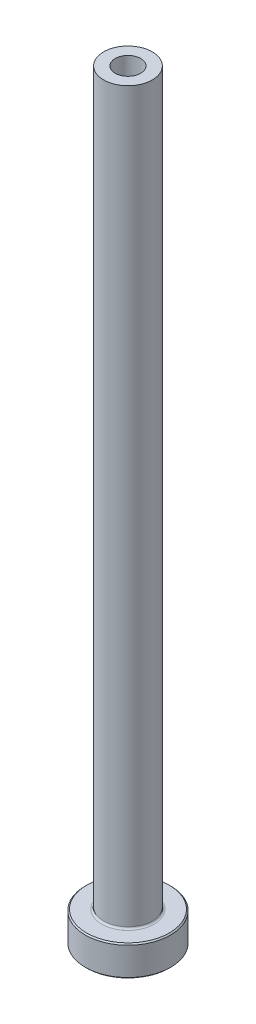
ISO-10303-21;
HEADER;
FILE_DESCRIPTION(('STEP AP214'),'2;1');
FILE_NAME('part.step','',(''),(''),'','','');
FILE_SCHEMA(('AUTOMOTIVE_DESIGN { 1 0 10303 214 1 1 1 1 }'));
ENDSEC;
DATA;
#1=APPLICATION_CONTEXT('core data for automotive mechanical design processes');
#2=APPLICATION_PROTOCOL_DEFINITION('international standard','automotive_design',2000,#1);
#3=PRODUCT_CONTEXT('',#1,'mechanical');
#4=PRODUCT('Part','Part','',(#3));
#5=PRODUCT_RELATED_PRODUCT_CATEGORY('part','',(#4));
#6=PRODUCT_DEFINITION_FORMATION('','',#4);
#7=PRODUCT_DEFINITION_CONTEXT('part definition',#1,'design');
#8=PRODUCT_DEFINITION('design','',#6,#7);
#9=PRODUCT_DEFINITION_SHAPE('','',#8);
#10=(LENGTH_UNIT() NAMED_UNIT(*) SI_UNIT(.MILLI.,.METRE.));
#11=(NAMED_UNIT(*) PLANE_ANGLE_UNIT() SI_UNIT($,.RADIAN.));
#12=(NAMED_UNIT(*) SI_UNIT($,.STERADIAN.) SOLID_ANGLE_UNIT());
#13=UNCERTAINTY_MEASURE_WITH_UNIT(LENGTH_MEASURE(1.E-05),#10,'distance_accuracy_value','');
#14=(GEOMETRIC_REPRESENTATION_CONTEXT(3) GLOBAL_UNCERTAINTY_ASSIGNED_CONTEXT((#13)) GLOBAL_UNIT_ASSIGNED_CONTEXT((#10,
#11,#12)) REPRESENTATION_CONTEXT('',''));
#15=CARTESIAN_POINT('',(0.,0.,0.));
#16=DIRECTION('',(0.,0.,1.));
#17=DIRECTION('',(1.,0.,0.));
#18=AXIS2_PLACEMENT_3D('',#15,#16,#17);
#19=CARTESIAN_POINT('',(0.,92.1876809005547,0.));
#20=DIRECTION('',(0.,1.,0.));
#21=DIRECTION('',(0.,0.,1.));
#22=AXIS2_PLACEMENT_3D('',#19,#20,#21);
#23=CYLINDRICAL_SURFACE('',#22,2.1);
#24=CARTESIAN_POINT('',(0.,125.,0.));
#25=DIRECTION('',(0.,1.,0.));
#26=DIRECTION('',(0.,0.,1.));
#27=AXIS2_PLACEMENT_3D('',#24,#25,#26);
#28=CIRCLE('',#27,2.1);
#29=CARTESIAN_POINT('',(0.,125.,2.1));
#30=VERTEX_POINT('',#29);
#31=EDGE_CURVE('E62',#30,#30,#28,.T.);
#32=ORIENTED_EDGE('',*,*,#31,.T.);
#33=EDGE_LOOP('',(#32));
#34=FACE_BOUND('',#33,.T.);
#35=CARTESIAN_POINT('',(0.,80.,0.));
#36=DIRECTION('',(0.,1.,0.));
#37=DIRECTION('',(0.,0.,1.));
#38=AXIS2_PLACEMENT_3D('',#35,#36,#37);
#39=CIRCLE('',#38,2.1);
#40=CARTESIAN_POINT('',(0.,80.,2.1));
#41=VERTEX_POINT('',#40);
#42=EDGE_CURVE('E71',#41,#41,#39,.T.);
#43=ORIENTED_EDGE('',*,*,#42,.F.);
#44=EDGE_LOOP('',(#43));
#45=FACE_BOUND('',#44,.T.);
#46=ADVANCED_FACE('F30',(#34,#45),#23,.F.);
#47=CARTESIAN_POINT('',(-2.1,125.,0.));
#48=DIRECTION('',(0.,1.,0.));
#49=DIRECTION('',(0.,0.,1.));
#50=AXIS2_PLACEMENT_3D('',#47,#48,#49);
#51=PLANE('',#50);
#52=CARTESIAN_POINT('',(0.,125.,0.));
#53=DIRECTION('',(0.,1.,0.));
#54=DIRECTION('',(0.,0.,1.));
#55=AXIS2_PLACEMENT_3D('',#52,#53,#54);
#56=CIRCLE('',#55,4.);
#57=CARTESIAN_POINT('',(0.,125.,4.));
#58=VERTEX_POINT('',#57);
#59=EDGE_CURVE('E65',#58,#58,#56,.T.);
#60=ORIENTED_EDGE('',*,*,#59,.T.);
#61=EDGE_LOOP('',(#60));
#62=FACE_BOUND('',#61,.T.);
#63=ORIENTED_EDGE('',*,*,#31,.F.);
#64=EDGE_LOOP('',(#63));
#65=FACE_BOUND('',#64,.T.);
#66=ADVANCED_FACE('F79',(#62,#65),#51,.T.);
#67=CARTESIAN_POINT('',(0.,92.1876809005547,0.));
#68=DIRECTION('',(0.,1.,0.));
#69=DIRECTION('',(0.,0.,1.));
#70=AXIS2_PLACEMENT_3D('',#67,#68,#69);
#71=CYLINDRICAL_SURFACE('',#70,4.);
#72=CARTESIAN_POINT('',(0.,5.3,0.));
#73=DIRECTION('',(0.,1.,0.));
#74=DIRECTION('',(0.,0.,1.));
#75=AXIS2_PLACEMENT_3D('',#72,#73,#74);
#76=CIRCLE('',#75,4.);
#77=CARTESIAN_POINT('',(0.,5.3,4.));
#78=VERTEX_POINT('',#77);
#79=EDGE_CURVE('E59',#78,#78,#76,.T.);
#80=ORIENTED_EDGE('',*,*,#79,.T.);
#81=EDGE_LOOP('',(#80));
#82=FACE_BOUND('',#81,.T.);
#83=ORIENTED_EDGE('',*,*,#59,.F.);
#84=EDGE_LOOP('',(#83));
#85=FACE_BOUND('',#84,.T.);
#86=ADVANCED_FACE('F85',(#82,#85),#71,.T.);
#87=CARTESIAN_POINT('',(-3.99999999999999,5.,0.));
#88=DIRECTION('',(0.,1.,0.));
#89=DIRECTION('',(0.,0.,1.));
#90=AXIS2_PLACEMENT_3D('',#87,#88,#89);
#91=PLANE('',#90);
#92=CARTESIAN_POINT('',(0.,5.,0.));
#93=DIRECTION('',(0.,1.,0.));
#94=DIRECTION('',(0.,0.,1.));
#95=AXIS2_PLACEMENT_3D('',#92,#93,#94);
#96=CIRCLE('',#95,6.79999999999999);
#97=CARTESIAN_POINT('',(0.,5.,6.79999999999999));
#98=VERTEX_POINT('',#97);
#99=EDGE_CURVE('E53',#98,#98,#96,.T.);
#100=ORIENTED_EDGE('',*,*,#99,.T.);
#101=EDGE_LOOP('',(#100));
#102=FACE_BOUND('',#101,.T.);
#103=CARTESIAN_POINT('',(0.,5.,0.));
#104=DIRECTION('',(0.,1.,0.));
#105=DIRECTION('',(0.,0.,1.));
#106=AXIS2_PLACEMENT_3D('',#103,#104,#105);
#107=CIRCLE('',#106,4.3);
#108=CARTESIAN_POINT('',(0.,5.,4.3));
#109=VERTEX_POINT('',#108);
#110=EDGE_CURVE('E56',#109,#109,#107,.F.);
#111=ORIENTED_EDGE('',*,*,#110,.T.);
#112=EDGE_LOOP('',(#111));
#113=FACE_BOUND('',#112,.T.);
#114=ADVANCED_FACE('F111',(#102,#113),#91,.T.);
#115=CARTESIAN_POINT('',(0.,92.1876809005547,0.));
#116=DIRECTION('',(0.,1.,0.));
#117=DIRECTION('',(0.,0.,1.));
#118=AXIS2_PLACEMENT_3D('',#115,#116,#117);
#119=CYLINDRICAL_SURFACE('',#118,6.99999999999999);
#120=CARTESIAN_POINT('',(0.,4.8,0.));
#121=DIRECTION('',(0.,1.,0.));
#122=DIRECTION('',(0.,0.,1.));
#123=AXIS2_PLACEMENT_3D('',#120,#121,#122);
#124=CIRCLE('',#123,6.99999999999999);
#125=CARTESIAN_POINT('',(0.,4.8,6.99999999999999));
#126=VERTEX_POINT('',#125);
#127=EDGE_CURVE('E45',#126,#126,#124,.F.);
#128=ORIENTED_EDGE('',*,*,#127,.T.);
#129=EDGE_LOOP('',(#128));
#130=FACE_BOUND('',#129,.T.);
#131=CARTESIAN_POINT('',(0.,0.200000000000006,0.));
#132=DIRECTION('',(0.,-1.,0.));
#133=DIRECTION('',(0.,0.,-1.));
#134=AXIS2_PLACEMENT_3D('',#131,#132,#133);
#135=CIRCLE('',#134,6.99999999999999);
#136=CARTESIAN_POINT('',(0.,0.200000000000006,-6.99999999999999));
#137=VERTEX_POINT('',#136);
#138=EDGE_CURVE('E50',#137,#137,#135,.F.);
#139=ORIENTED_EDGE('',*,*,#138,.T.);
#140=EDGE_LOOP('',(#139));
#141=FACE_BOUND('',#140,.T.);
#142=ADVANCED_FACE('F108',(#130,#141),#119,.T.);
#143=CARTESIAN_POINT('',(-6.99999999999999,0.,0.));
#144=DIRECTION('',(0.,-1.,0.));
#145=DIRECTION('',(0.,0.,-1.));
#146=AXIS2_PLACEMENT_3D('',#143,#144,#145);
#147=PLANE('',#146);
#148=CARTESIAN_POINT('',(0.,0.,0.));
#149=DIRECTION('',(0.,-1.,0.));
#150=DIRECTION('',(0.,0.,-1.));
#151=AXIS2_PLACEMENT_3D('',#148,#149,#150);
#152=CIRCLE('',#151,2.84999999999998);
#153=CARTESIAN_POINT('',(0.,0.,-2.84999999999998));
#154=VERTEX_POINT('',#153);
#155=EDGE_CURVE('E37',#154,#154,#152,.F.);
#156=ORIENTED_EDGE('',*,*,#155,.T.);
#157=EDGE_LOOP('',(#156));
#158=FACE_BOUND('',#157,.T.);
#159=CARTESIAN_POINT('',(0.,0.,0.));
#160=DIRECTION('',(0.,-1.,0.));
#161=DIRECTION('',(0.,0.,-1.));
#162=AXIS2_PLACEMENT_3D('',#159,#160,#161);
#163=CIRCLE('',#162,6.8);
#164=CARTESIAN_POINT('',(0.,0.,-6.8));
#165=VERTEX_POINT('',#164);
#166=EDGE_CURVE('E41',#165,#165,#163,.T.);
#167=ORIENTED_EDGE('',*,*,#166,.T.);
#168=EDGE_LOOP('',(#167));
#169=FACE_BOUND('',#168,.T.);
#170=ADVANCED_FACE('F110',(#158,#169),#147,.T.);
#171=CARTESIAN_POINT('',(0.,92.1876809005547,0.));
#172=DIRECTION('',(0.,1.,0.));
#173=DIRECTION('',(0.,0.,1.));
#174=AXIS2_PLACEMENT_3D('',#171,#172,#173);
#175=CYLINDRICAL_SURFACE('',#174,2.34999999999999);
#176=CARTESIAN_POINT('',(0.,0.5,0.));
#177=DIRECTION('',(0.,-1.,0.));
#178=DIRECTION('',(0.,0.,-1.));
#179=AXIS2_PLACEMENT_3D('',#176,#177,#178);
#180=CIRCLE('',#179,2.34999999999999);
#181=CARTESIAN_POINT('',(0.,0.5,-2.34999999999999));
#182=VERTEX_POINT('',#181);
#183=EDGE_CURVE('E10',#182,#182,#180,.T.);
#184=ORIENTED_EDGE('',*,*,#183,.T.);
#185=EDGE_LOOP('',(#184));
#186=FACE_BOUND('',#185,.T.);
#187=CARTESIAN_POINT('',(0.,68.,0.));
#188=DIRECTION('',(0.,1.,0.));
#189=DIRECTION('',(0.,0.,1.));
#190=AXIS2_PLACEMENT_3D('',#187,#188,#189);
#191=CIRCLE('',#190,2.35);
#192=CARTESIAN_POINT('',(0.,68.,2.35));
#193=VERTEX_POINT('',#192);
#194=EDGE_CURVE('E68',#193,#193,#191,.T.);
#195=ORIENTED_EDGE('',*,*,#194,.T.);
#196=EDGE_LOOP('',(#195));
#197=FACE_BOUND('',#196,.T.);
#198=ADVANCED_FACE('F118',(#186,#197),#175,.F.);
#199=CARTESIAN_POINT('',(0.,68.,0.));
#200=DIRECTION('',(0.,-1.,0.));
#201=DIRECTION('',(0.,0.,-1.));
#202=AXIS2_PLACEMENT_3D('',#199,#200,#201);
#203=CONICAL_SURFACE('',#202,2.35,0.0208303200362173);
#204=ORIENTED_EDGE('',*,*,#42,.T.);
#205=EDGE_LOOP('',(#204));
#206=FACE_BOUND('',#205,.T.);
#207=ORIENTED_EDGE('',*,*,#194,.F.);
#208=EDGE_LOOP('',(#207));
#209=FACE_BOUND('',#208,.T.);
#210=ADVANCED_FACE('F75',(#206,#209),#203,.F.);
#211=CARTESIAN_POINT('',(0.,5.3,0.));
#212=DIRECTION('',(0.,1.,0.));
#213=DIRECTION('',(0.,0.,1.));
#214=AXIS2_PLACEMENT_3D('',#211,#212,#213);
#215=TOROIDAL_SURFACE('',#214,4.3,0.3);
#216=ORIENTED_EDGE('',*,*,#110,.F.);
#217=EDGE_LOOP('',(#216));
#218=FACE_BOUND('',#217,.T.);
#219=ORIENTED_EDGE('',*,*,#79,.F.);
#220=EDGE_LOOP('',(#219));
#221=FACE_BOUND('',#220,.T.);
#222=ADVANCED_FACE('F90',(#218,#221),#215,.F.);
#223=CARTESIAN_POINT('',(0.,5.,0.));
#224=DIRECTION('',(0.,-1.,0.));
#225=DIRECTION('',(0.,0.,-1.));
#226=AXIS2_PLACEMENT_3D('',#223,#224,#225);
#227=CONICAL_SURFACE('',#226,6.79999999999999,0.78539816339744);
#228=ORIENTED_EDGE('',*,*,#127,.F.);
#229=EDGE_LOOP('',(#228));
#230=FACE_BOUND('',#229,.T.);
#231=ORIENTED_EDGE('',*,*,#99,.F.);
#232=EDGE_LOOP('',(#231));
#233=FACE_BOUND('',#232,.T.);
#234=ADVANCED_FACE('F93',(#230,#233),#227,.T.);
#235=CARTESIAN_POINT('',(0.,0.200000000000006,0.));
#236=DIRECTION('',(0.,1.,0.));
#237=DIRECTION('',(0.,0.,1.));
#238=AXIS2_PLACEMENT_3D('',#235,#236,#237);
#239=CONICAL_SURFACE('',#238,6.99999999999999,0.785398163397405);
#240=ORIENTED_EDGE('',*,*,#166,.F.);
#241=EDGE_LOOP('',(#240));
#242=FACE_BOUND('',#241,.T.);
#243=ORIENTED_EDGE('',*,*,#138,.F.);
#244=EDGE_LOOP('',(#243));
#245=FACE_BOUND('',#244,.T.);
#246=ADVANCED_FACE('F96',(#242,#245),#239,.T.);
#247=CARTESIAN_POINT('',(0.,0.,0.));
#248=DIRECTION('',(0.,-1.,0.));
#249=DIRECTION('',(0.,0.,-1.));
#250=AXIS2_PLACEMENT_3D('',#247,#248,#249);
#251=CONICAL_SURFACE('',#250,2.84999999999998,0.785398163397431);
#252=ORIENTED_EDGE('',*,*,#183,.F.);
#253=EDGE_LOOP('',(#252));
#254=FACE_BOUND('',#253,.T.);
#255=ORIENTED_EDGE('',*,*,#155,.F.);
#256=EDGE_LOOP('',(#255));
#257=FACE_BOUND('',#256,.T.);
#258=ADVANCED_FACE('F32',(#254,#257),#251,.F.);
#259=CLOSED_SHELL('',(#46,#66,#86,#114,#142,#170,#198,#210,#222,#234,#246,#258));
#260=MANIFOLD_SOLID_BREP('B2',#259);
#261=ADVANCED_BREP_SHAPE_REPRESENTATION('',(#18,#260),#14);
#262=SHAPE_DEFINITION_REPRESENTATION(#9,#261);
ENDSEC;
END-ISO-10303-21;
